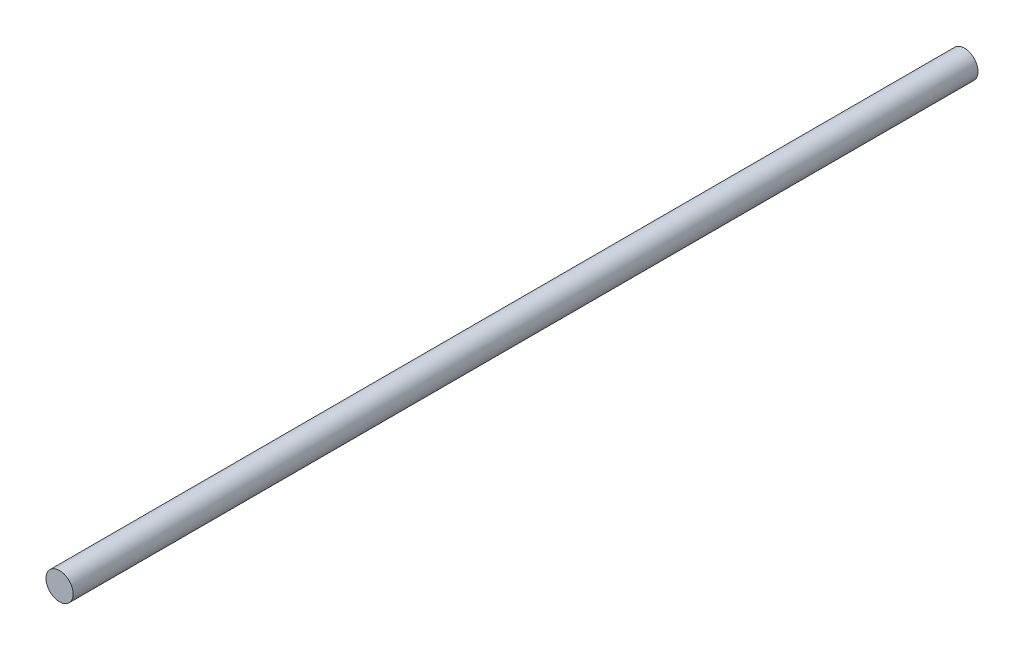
from build123d import *

# Parameters (mm, degrees)
AUFSATZ_LIN_GK_START = -50
PROFIL_R             = 0.75
AUFSATZ_LIN_GK_DEPTH = 50


with BuildPart() as part:
    # Profil → Aufsatz-Lin_GK (new body)
    with BuildSketch(Plane.XY.offset(AUFSATZ_LIN_GK_START)):
        Circle(PROFIL_R)
    extrude(amount=AUFSATZ_LIN_GK_DEPTH)


solid = part.part
